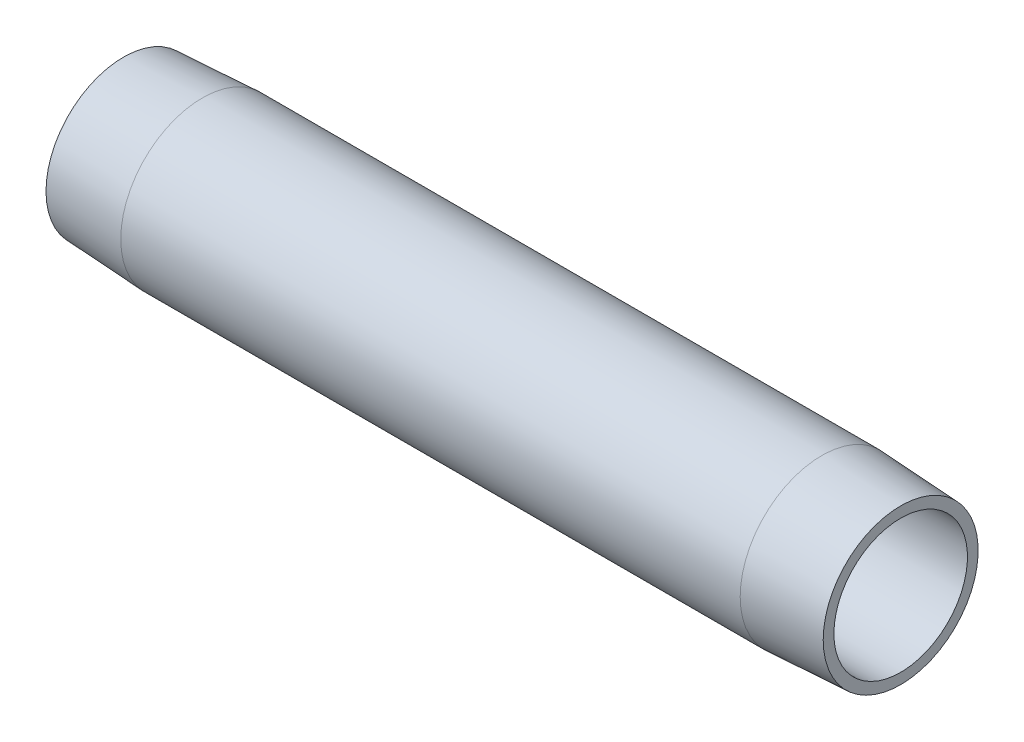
from build123d import *


with BuildPart() as part:
    # Sketch1 → Revolve1 (revolve)
    with BuildSketch(Plane.XY, mode=Mode.PRIVATE) as revolve1_sk:
        Polygon((101.6, 8.73125), (0, 8.73125), (0, 10.127550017), (10.3124, 10.668), (91.2876, 10.668), (101.6, 10.127550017), align=None)
    revolve(revolve1_sk.sketch.rotate(Axis((0, 0, 0), (1, 0, 0)), 90), axis=Axis((0, 0, 0), (1, 0, 0)))


solid = part.part
